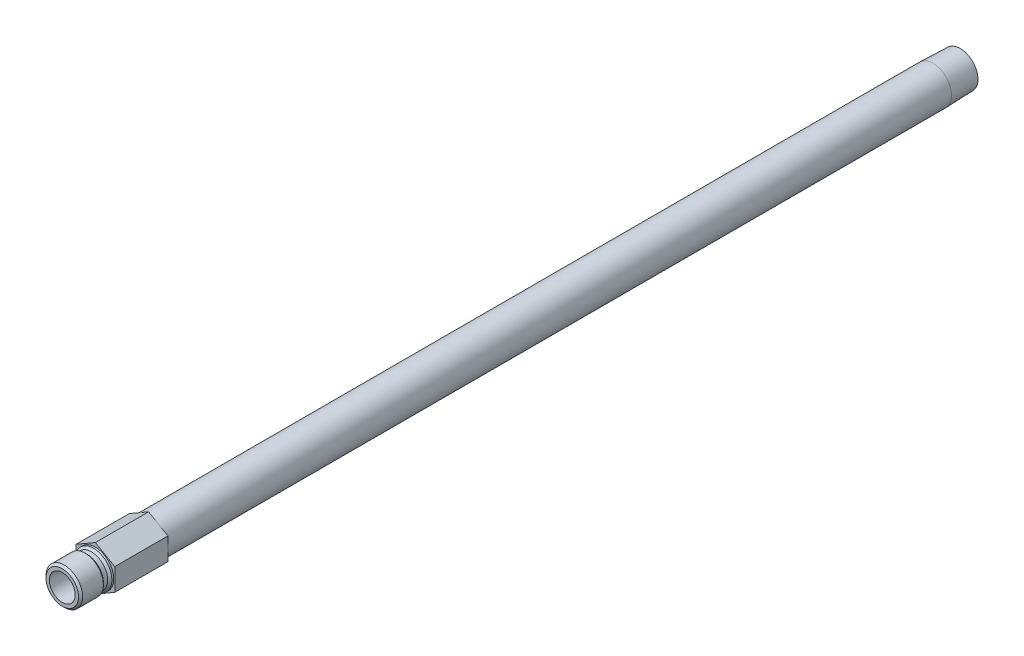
from build123d import *

# Parameters (mm, degrees)
SKETCH2_R           = 4.6228
BOSS_EXTRUDE1_DEPTH = 19.558


with BuildPart() as part:
    # Sketch1 → Revolve1 (revolve)
    with BuildSketch(Plane(origin=(0, 0, 0), x_dir=(0, 0, -1), z_dir=(1, 0, 0))):
        Polygon((-12.192, 4.7625), (-12.192, 5.9817), (-11.43, 6.7437), (-3.81, 6.7437), (-3.048, 5.9817), (-1.4605, 5.9817), (-0.6985, 6.7437), (0, 6.7437), (0, 6.858), (307.975, 6.858), (318.008, 6.544470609), (318.008, 4.6228), (0.074279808, 4.6228), (0, 4.7625), align=None)
    revolve(axis=Axis((0, 0, 0), (0, 0, 1)))

    # Sketch2 → Boss-Extrude1 (add)
    with BuildSketch(Plane.XY):
        Polygon((-7.112, 4.106115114), (-7.112, -4.106115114), (0, -8.212230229), (7.112, -4.106115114), (7.112, 4.106115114), (0, 8.212230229), align=None)
        with Locations(Location((0, 0, 0), (0, 0, 90))):
            Circle(SKETCH2_R, mode=Mode.SUBTRACT)
    extrude(amount=-BOSS_EXTRUDE1_DEPTH)


solid = part.part
